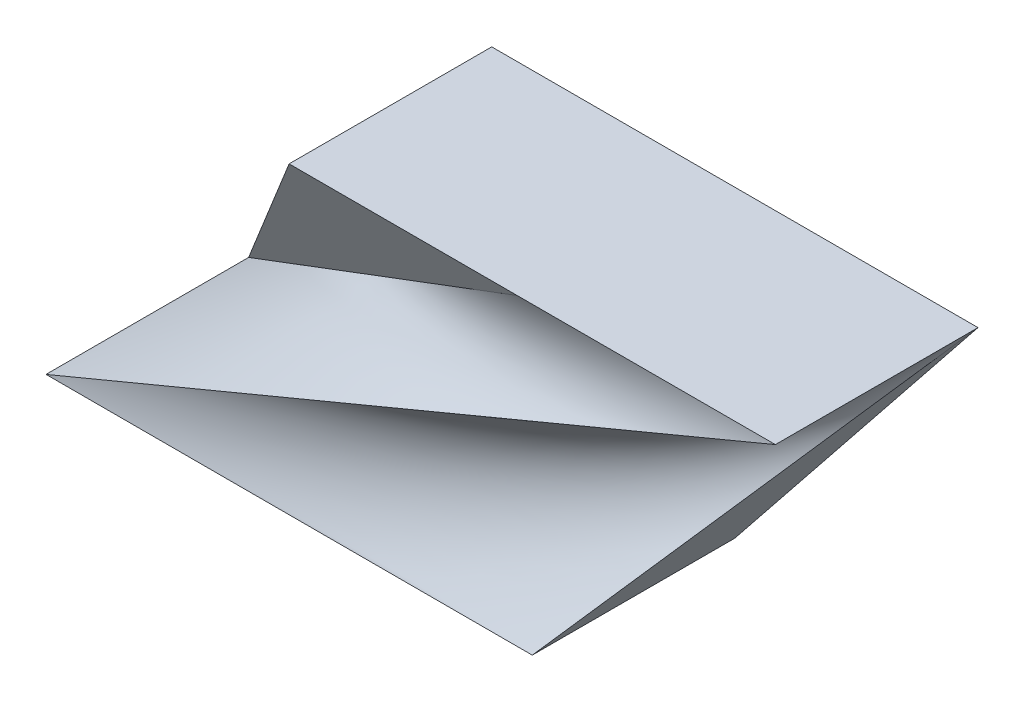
ISO-10303-21;
HEADER;
FILE_DESCRIPTION(('STEP AP214'),'2;1');
FILE_NAME('part.step','',(''),(''),'','','');
FILE_SCHEMA(('AUTOMOTIVE_DESIGN { 1 0 10303 214 1 1 1 1 }'));
ENDSEC;
DATA;
#1=APPLICATION_CONTEXT('core data for automotive mechanical design processes');
#2=APPLICATION_PROTOCOL_DEFINITION('international standard','automotive_design',2000,#1);
#3=PRODUCT_CONTEXT('',#1,'mechanical');
#4=PRODUCT('Part','Part','',(#3));
#5=PRODUCT_RELATED_PRODUCT_CATEGORY('part','',(#4));
#6=PRODUCT_DEFINITION_FORMATION('','',#4);
#7=PRODUCT_DEFINITION_CONTEXT('part definition',#1,'design');
#8=PRODUCT_DEFINITION('design','',#6,#7);
#9=PRODUCT_DEFINITION_SHAPE('','',#8);
#10=(LENGTH_UNIT() NAMED_UNIT(*) SI_UNIT(.MILLI.,.METRE.));
#11=(NAMED_UNIT(*) PLANE_ANGLE_UNIT() SI_UNIT($,.RADIAN.));
#12=(NAMED_UNIT(*) SI_UNIT($,.STERADIAN.) SOLID_ANGLE_UNIT());
#13=UNCERTAINTY_MEASURE_WITH_UNIT(LENGTH_MEASURE(1.E-05),#10,'distance_accuracy_value','');
#14=(GEOMETRIC_REPRESENTATION_CONTEXT(3) GLOBAL_UNCERTAINTY_ASSIGNED_CONTEXT((#13)) GLOBAL_UNIT_ASSIGNED_CONTEXT((#10,
#11,#12)) REPRESENTATION_CONTEXT('',''));
#15=CARTESIAN_POINT('',(0.,0.,0.));
#16=DIRECTION('',(0.,0.,1.));
#17=DIRECTION('',(1.,0.,0.));
#18=AXIS2_PLACEMENT_3D('',#15,#16,#17);
#19=CARTESIAN_POINT('',(0.,0.,50.));
#20=DIRECTION('',(0.,1.,0.));
#21=DIRECTION('',(0.,0.,1.));
#22=AXIS2_PLACEMENT_3D('',#19,#20,#21);
#23=PLANE('',#22);
#24=DIRECTION('',(0.,0.,1.));
#25=VECTOR('',#24,1.);
#26=CARTESIAN_POINT('',(0.,0.,0.));
#27=LINE('',#26,#25);
#28=CARTESIAN_POINT('',(0.,0.,0.));
#29=VERTEX_POINT('',#28);
#30=CARTESIAN_POINT('',(0.,0.,50.));
#31=VERTEX_POINT('',#30);
#32=EDGE_CURVE('E113',#29,#31,#27,.T.);
#33=ORIENTED_EDGE('',*,*,#32,.F.);
#34=DIRECTION('',(-1.,0.,0.));
#35=VECTOR('',#34,1.);
#36=CARTESIAN_POINT('',(0.,0.,0.));
#37=LINE('',#36,#35);
#38=CARTESIAN_POINT('',(120.,0.,0.));
#39=VERTEX_POINT('',#38);
#40=EDGE_CURVE('E120',#39,#29,#37,.T.);
#41=ORIENTED_EDGE('',*,*,#40,.F.);
#42=DIRECTION('',(0.,0.,-1.));
#43=VECTOR('',#42,1.);
#44=CARTESIAN_POINT('',(120.,0.,0.));
#45=LINE('',#44,#43);
#46=CARTESIAN_POINT('',(120.,0.,50.));
#47=VERTEX_POINT('',#46);
#48=EDGE_CURVE('E126',#47,#39,#45,.T.);
#49=ORIENTED_EDGE('',*,*,#48,.F.);
#50=DIRECTION('',(1.,0.,0.));
#51=VECTOR('',#50,1.);
#52=CARTESIAN_POINT('',(0.,0.,50.));
#53=LINE('',#52,#51);
#54=EDGE_CURVE('E131',#31,#47,#53,.T.);
#55=ORIENTED_EDGE('',*,*,#54,.F.);
#56=EDGE_LOOP('',(#33,#41,#49,#55));
#57=FACE_BOUND('',#56,.T.);
#58=ADVANCED_FACE('F42',(#57),#23,.F.);
#59=CARTESIAN_POINT('',(60.,75.,50.));
#60=DIRECTION('',(0.,1.,0.));
#61=DIRECTION('',(0.,0.,1.));
#62=AXIS2_PLACEMENT_3D('',#59,#60,#61);
#63=PLANE('',#62);
#64=DIRECTION('',(0.,0.,1.));
#65=VECTOR('',#64,1.);
#66=CARTESIAN_POINT('',(60.,75.,0.));
#67=LINE('',#66,#65);
#68=CARTESIAN_POINT('',(60.,75.,0.));
#69=VERTEX_POINT('',#68);
#70=CARTESIAN_POINT('',(60.,75.,50.));
#71=VERTEX_POINT('',#70);
#72=EDGE_CURVE('E93',#69,#71,#67,.T.);
#73=ORIENTED_EDGE('',*,*,#72,.T.);
#74=DIRECTION('',(1.,0.,0.));
#75=VECTOR('',#74,1.);
#76=CARTESIAN_POINT('',(60.,75.,50.));
#77=LINE('',#76,#75);
#78=CARTESIAN_POINT('',(116.281079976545,75.,50.));
#79=VERTEX_POINT('',#78);
#80=EDGE_CURVE('E62',#71,#79,#77,.T.);
#81=ORIENTED_EDGE('',*,*,#80,.T.);
#82=CARTESIAN_POINT('',(180.,75.,50.));
#83=VERTEX_POINT('',#82);
#84=EDGE_CURVE('E116',#79,#83,#77,.T.);
#85=ORIENTED_EDGE('',*,*,#84,.T.);
#86=DIRECTION('',(0.,0.,-1.));
#87=VECTOR('',#86,1.);
#88=CARTESIAN_POINT('',(180.,75.,0.));
#89=LINE('',#88,#87);
#90=CARTESIAN_POINT('',(180.,75.,0.));
#91=VERTEX_POINT('',#90);
#92=EDGE_CURVE('E54',#83,#91,#89,.T.);
#93=ORIENTED_EDGE('',*,*,#92,.T.);
#94=DIRECTION('',(-1.,0.,0.));
#95=VECTOR('',#94,1.);
#96=CARTESIAN_POINT('',(60.,75.,0.));
#97=LINE('',#96,#95);
#98=EDGE_CURVE('E12',#91,#69,#97,.T.);
#99=ORIENTED_EDGE('',*,*,#98,.T.);
#100=EDGE_LOOP('',(#73,#81,#85,#93,#99));
#101=FACE_BOUND('',#100,.T.);
#102=ADVANCED_FACE('F44',(#101),#63,.T.);
#103=CARTESIAN_POINT('',(180.,75.,50.));
#104=CARTESIAN_POINT('',(0.,0.,50.));
#105=CARTESIAN_POINT('',(169.380179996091,75.,50.));
#106=CARTESIAN_POINT('',(0.,0.,41.6666666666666));
#107=CARTESIAN_POINT('',(158.760359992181,75.,50.));
#108=CARTESIAN_POINT('',(0.,0.,33.3333333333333));
#109=CARTESIAN_POINT('',(137.520719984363,75.,50.));
#110=CARTESIAN_POINT('',(0.,0.,16.6666666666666));
#111=CARTESIAN_POINT('',(126.900899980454,75.,50.));
#112=CARTESIAN_POINT('',(0.,0.,8.33333333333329));
#113=CARTESIAN_POINT('',(116.281079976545,75.,50.));
#114=CARTESIAN_POINT('',(0.,0.,0.));
#115=B_SPLINE_SURFACE_WITH_KNOTS('',3,1,((#103,#104),(#105,#106),(#107,#108),(#109,#110),(#111,
#112),(#113,#114)),.UNSPECIFIED.,.F.,.F.,.F.,(4,2,4),(2,2),(0.,0.5,1.),(0.,1.),.UNSPECIFIED.);
#116=DIRECTION('',(-0.790346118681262,-0.509764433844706,-0.339842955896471));
#117=VECTOR('',#116,1.);
#118=CARTESIAN_POINT('',(58.1405399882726,37.5,25.));
#119=LINE('',#118,#117);
#120=EDGE_CURVE('E104',#79,#29,#119,.T.);
#121=DIRECTION('',(0.923076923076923,0.384615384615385,0.));
#122=VECTOR('',#121,1.);
#123=CARTESIAN_POINT('',(90.,37.5,50.));
#124=LINE('',#123,#122);
#125=EDGE_CURVE('E106',#31,#83,#124,.T.);
#126=ORIENTED_EDGE('',*,*,#84,.F.);
#127=ORIENTED_EDGE('',*,*,#120,.T.);
#128=ORIENTED_EDGE('',*,*,#32,.T.);
#129=ORIENTED_EDGE('',*,*,#125,.T.);
#130=EDGE_LOOP('',(#126,#127,#128,#129));
#131=FACE_BOUND('',#130,.T.);
#132=ADVANCED_FACE('F110',(#131),#115,.T.);
#133=CARTESIAN_POINT('',(116.281079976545,75.,50.));
#134=DIRECTION('',(0.,-0.554700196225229,0.832050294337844));
#135=DIRECTION('',(-1.,0.,0.));
#136=AXIS2_PLACEMENT_3D('',#133,#134,#135);
#137=PLANE('',#136);
#138=ORIENTED_EDGE('',*,*,#80,.F.);
#139=DIRECTION('',(-0.554108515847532,-0.692635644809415,-0.46175709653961));
#140=VECTOR('',#139,1.);
#141=CARTESIAN_POINT('',(30.,37.5,25.));
#142=LINE('',#141,#140);
#143=EDGE_CURVE('E71',#71,#29,#142,.T.);
#144=ORIENTED_EDGE('',*,*,#143,.T.);
#145=ORIENTED_EDGE('',*,*,#120,.F.);
#146=EDGE_LOOP('',(#138,#144,#145));
#147=FACE_BOUND('',#146,.T.);
#148=ADVANCED_FACE('F103',(#147),#137,.T.);
#149=CARTESIAN_POINT('',(180.,75.,0.));
#150=CARTESIAN_POINT('',(120.,0.,50.));
#151=CARTESIAN_POINT('',(180.,75.,50.));
#152=CARTESIAN_POINT('',(0.,0.,50.));
#153=B_SPLINE_SURFACE_WITH_KNOTS('',1,1,((#149,#150),(#151,#152)),.UNSPECIFIED.,.F.,.F.,.F.,(2,
2),(2,2),(0.,1.),(0.,1.),.UNSPECIFIED.);
#154=DIRECTION('',(-0.554108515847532,-0.692635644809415,0.46175709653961));
#155=VECTOR('',#154,1.);
#156=CARTESIAN_POINT('',(180.,75.,0.));
#157=LINE('',#156,#155);
#158=EDGE_CURVE('E125',#91,#47,#157,.T.);
#159=ORIENTED_EDGE('',*,*,#92,.F.);
#160=ORIENTED_EDGE('',*,*,#125,.F.);
#161=ORIENTED_EDGE('',*,*,#54,.T.);
#162=ORIENTED_EDGE('',*,*,#158,.F.);
#163=EDGE_LOOP('',(#159,#160,#161,#162));
#164=FACE_BOUND('',#163,.T.);
#165=ADVANCED_FACE('F229',(#164),#153,.T.);
#166=CARTESIAN_POINT('',(60.,75.,50.));
#167=DIRECTION('',(-0.78086880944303,0.624695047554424,0.));
#168=DIRECTION('',(0.,0.,-1.));
#169=AXIS2_PLACEMENT_3D('',#166,#167,#168);
#170=PLANE('',#169);
#171=ORIENTED_EDGE('',*,*,#72,.F.);
#172=DIRECTION('',(-0.624695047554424,-0.78086880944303,0.));
#173=VECTOR('',#172,1.);
#174=CARTESIAN_POINT('',(30.,37.5,0.));
#175=LINE('',#174,#173);
#176=EDGE_CURVE('E91',#69,#29,#175,.T.);
#177=ORIENTED_EDGE('',*,*,#176,.T.);
#178=ORIENTED_EDGE('',*,*,#143,.F.);
#179=EDGE_LOOP('',(#171,#177,#178));
#180=FACE_BOUND('',#179,.T.);
#181=ADVANCED_FACE('F92',(#180),#170,.T.);
#182=CARTESIAN_POINT('',(60.,75.,0.));
#183=DIRECTION('',(0.,0.,-1.));
#184=DIRECTION('',(1.,0.,0.));
#185=AXIS2_PLACEMENT_3D('',#182,#183,#184);
#186=PLANE('',#185);
#187=ORIENTED_EDGE('',*,*,#98,.F.);
#188=DIRECTION('',(-0.624695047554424,-0.78086880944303,0.));
#189=VECTOR('',#188,1.);
#190=CARTESIAN_POINT('',(180.,75.,0.));
#191=LINE('',#190,#189);
#192=EDGE_CURVE('E98',#91,#39,#191,.T.);
#193=ORIENTED_EDGE('',*,*,#192,.T.);
#194=ORIENTED_EDGE('',*,*,#40,.T.);
#195=ORIENTED_EDGE('',*,*,#176,.F.);
#196=EDGE_LOOP('',(#187,#193,#194,#195));
#197=FACE_BOUND('',#196,.T.);
#198=ADVANCED_FACE('F121',(#197),#186,.T.);
#199=CARTESIAN_POINT('',(120.,0.,50.));
#200=DIRECTION('',(0.78086880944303,-0.624695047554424,0.));
#201=DIRECTION('',(0.624695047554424,0.78086880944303,0.));
#202=AXIS2_PLACEMENT_3D('',#199,#200,#201);
#203=PLANE('',#202);
#204=ORIENTED_EDGE('',*,*,#158,.T.);
#205=ORIENTED_EDGE('',*,*,#48,.T.);
#206=ORIENTED_EDGE('',*,*,#192,.F.);
#207=EDGE_LOOP('',(#204,#205,#206));
#208=FACE_BOUND('',#207,.T.);
#209=ADVANCED_FACE('F148',(#208),#203,.T.);
#210=CLOSED_SHELL('',(#58,#102,#132,#148,#165,#181,#198,#209));
#211=MANIFOLD_SOLID_BREP('B2',#210);
#212=ADVANCED_BREP_SHAPE_REPRESENTATION('',(#18,#211),#14);
#213=SHAPE_DEFINITION_REPRESENTATION(#9,#212);
ENDSEC;
END-ISO-10303-21;
